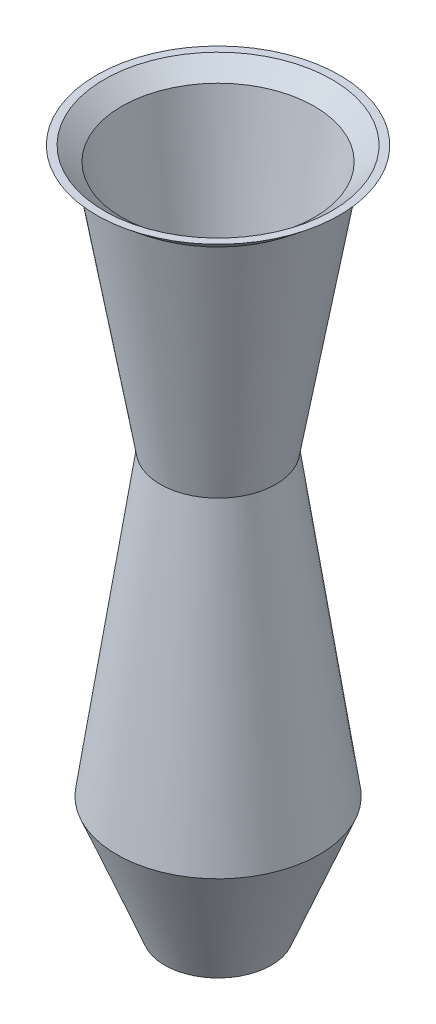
ISO-10303-21;
HEADER;
FILE_DESCRIPTION(('STEP AP214'),'2;1');
FILE_NAME('part.step','',(''),(''),'','','');
FILE_SCHEMA(('AUTOMOTIVE_DESIGN { 1 0 10303 214 1 1 1 1 }'));
ENDSEC;
DATA;
#1=APPLICATION_CONTEXT('core data for automotive mechanical design processes');
#2=APPLICATION_PROTOCOL_DEFINITION('international standard','automotive_design',2000,#1);
#3=PRODUCT_CONTEXT('',#1,'mechanical');
#4=PRODUCT('Part','Part','',(#3));
#5=PRODUCT_RELATED_PRODUCT_CATEGORY('part','',(#4));
#6=PRODUCT_DEFINITION_FORMATION('','',#4);
#7=PRODUCT_DEFINITION_CONTEXT('part definition',#1,'design');
#8=PRODUCT_DEFINITION('design','',#6,#7);
#9=PRODUCT_DEFINITION_SHAPE('','',#8);
#10=(LENGTH_UNIT() NAMED_UNIT(*) SI_UNIT(.MILLI.,.METRE.));
#11=(NAMED_UNIT(*) PLANE_ANGLE_UNIT() SI_UNIT($,.RADIAN.));
#12=(NAMED_UNIT(*) SI_UNIT($,.STERADIAN.) SOLID_ANGLE_UNIT());
#13=UNCERTAINTY_MEASURE_WITH_UNIT(LENGTH_MEASURE(1.E-05),#10,'distance_accuracy_value','');
#14=(GEOMETRIC_REPRESENTATION_CONTEXT(3) GLOBAL_UNCERTAINTY_ASSIGNED_CONTEXT((#13)) GLOBAL_UNIT_ASSIGNED_CONTEXT((#10,
#11,#12)) REPRESENTATION_CONTEXT('',''));
#15=CARTESIAN_POINT('',(0.,0.,0.));
#16=DIRECTION('',(0.,0.,1.));
#17=DIRECTION('',(1.,0.,0.));
#18=AXIS2_PLACEMENT_3D('',#15,#16,#17);
#19=CARTESIAN_POINT('',(0.,-806.372693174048,0.));
#20=DIRECTION('',(0.,-1.,0.));
#21=DIRECTION('',(1.,0.,0.));
#22=AXIS2_PLACEMENT_3D('',#19,#20,#21);
#23=PLANE('',#22);
#24=CARTESIAN_POINT('',(2.7660591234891E-12,-806.372693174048,0.));
#25=DIRECTION('',(0.,-1.,0.));
#26=DIRECTION('',(1.,0.,0.));
#27=AXIS2_PLACEMENT_3D('',#24,#25,#26);
#28=CIRCLE('',#27,253.999999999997);
#29=CARTESIAN_POINT('',(254.,-806.372693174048,0.));
#30=VERTEX_POINT('',#29);
#31=EDGE_CURVE('E82',#30,#30,#28,.T.);
#32=ORIENTED_EDGE('',*,*,#31,.F.);
#33=EDGE_LOOP('',(#32));
#34=FACE_BOUND('',#33,.T.);
#35=CARTESIAN_POINT('',(2.7660591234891E-12,-806.372693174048,0.));
#36=DIRECTION('',(0.,-1.,0.));
#37=DIRECTION('',(1.,0.,0.));
#38=AXIS2_PLACEMENT_3D('',#35,#36,#37);
#39=CIRCLE('',#38,281.356637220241);
#40=CARTESIAN_POINT('',(281.356637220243,-806.372693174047,0.));
#41=VERTEX_POINT('',#40);
#42=EDGE_CURVE('E53',#41,#41,#39,.T.);
#43=ORIENTED_EDGE('',*,*,#42,.T.);
#44=EDGE_LOOP('',(#43));
#45=FACE_BOUND('',#44,.T.);
#46=ADVANCED_FACE('F44',(#34,#45),#23,.T.);
#47=CARTESIAN_POINT('',(2.79841777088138E-12,-815.806016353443,0.));
#48=DIRECTION('',(0.,1.,0.));
#49=DIRECTION('',(-1.,0.,0.));
#50=AXIS2_PLACEMENT_3D('',#47,#48,#49);
#51=CONICAL_SURFACE('',#50,277.583307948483,0.380506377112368);
#52=CARTESIAN_POINT('',(5.98487426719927E-13,-174.47346443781,0.));
#53=DIRECTION('',(0.,-1.,0.));
#54=DIRECTION('',(1.,0.,0.));
#55=AXIS2_PLACEMENT_3D('',#52,#53,#54);
#56=CIRCLE('',#55,534.116328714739);
#57=CARTESIAN_POINT('',(534.116328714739,-174.473464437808,0.));
#58=VERTEX_POINT('',#57);
#59=EDGE_CURVE('E59',#58,#58,#56,.T.);
#60=ORIENTED_EDGE('',*,*,#59,.T.);
#61=EDGE_LOOP('',(#60));
#62=FACE_BOUND('',#61,.T.);
#63=ORIENTED_EDGE('',*,*,#42,.F.);
#64=EDGE_LOOP('',(#63));
#65=FACE_BOUND('',#64,.T.);
#66=ADVANCED_FACE('F123',(#62,#65),#51,.T.);
#67=CARTESIAN_POINT('',(5.75334534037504E-13,-167.723839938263,0.));
#68=DIRECTION('',(0.,-1.,0.));
#69=DIRECTION('',(1.,0.,0.));
#70=AXIS2_PLACEMENT_3D('',#67,#68,#69);
#71=CONICAL_SURFACE('',#70,533.136544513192,0.144154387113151);
#72=CARTESIAN_POINT('',(-4.81290421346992E-12,1403.07721539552,0.));
#73=DIRECTION('',(0.,-1.,0.));
#74=DIRECTION('',(1.,0.,0.));
#75=AXIS2_PLACEMENT_3D('',#72,#73,#74);
#76=CIRCLE('',#75,305.117036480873);
#77=CARTESIAN_POINT('',(305.117036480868,1403.07721539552,0.));
#78=VERTEX_POINT('',#77);
#79=EDGE_CURVE('E10',#78,#78,#76,.T.);
#80=ORIENTED_EDGE('',*,*,#79,.T.);
#81=EDGE_LOOP('',(#80));
#82=FACE_BOUND('',#81,.T.);
#83=ORIENTED_EDGE('',*,*,#59,.F.);
#84=EDGE_LOOP('',(#83));
#85=FACE_BOUND('',#84,.T.);
#86=ADVANCED_FACE('F129',(#82,#85),#71,.T.);
#87=CARTESIAN_POINT('',(-4.79924612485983E-12,1399.09555440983,0.));
#88=DIRECTION('',(0.,1.,0.));
#89=DIRECTION('',(-1.,0.,0.));
#90=AXIS2_PLACEMENT_3D('',#87,#88,#89);
#91=CONICAL_SURFACE('',#90,304.427902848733,0.171379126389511);
#92=ORIENTED_EDGE('',*,*,#79,.F.);
#93=EDGE_LOOP('',(#92));
#94=FACE_BOUND('',#93,.T.);
#95=CARTESIAN_POINT('',(-9.2980222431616E-12,2710.59688266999,0.));
#96=DIRECTION('',(0.,-1.,0.));
#97=DIRECTION('',(1.,0.,0.));
#98=AXIS2_PLACEMENT_3D('',#95,#96,#97);
#99=CIRCLE('',#98,531.418517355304);
#100=CARTESIAN_POINT('',(531.418517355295,2710.59688266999,0.));
#101=VERTEX_POINT('',#100);
#102=EDGE_CURVE('E63',#101,#101,#99,.T.);
#103=ORIENTED_EDGE('',*,*,#102,.T.);
#104=EDGE_LOOP('',(#103));
#105=FACE_BOUND('',#104,.T.);
#106=ADVANCED_FACE('F138',(#94,#105),#91,.T.);
#107=CARTESIAN_POINT('',(-9.27746780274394E-12,2704.60476943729,0.));
#108=DIRECTION('',(0.,1.,0.));
#109=DIRECTION('',(-1.,0.,0.));
#110=AXIS2_PLACEMENT_3D('',#107,#108,#109);
#111=CONICAL_SURFACE('',#110,524.128112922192,0.882833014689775);
#112=CARTESIAN_POINT('',(-9.60616296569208E-12,2800.42730682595,0.));
#113=DIRECTION('',(0.,1.,0.));
#114=DIRECTION('',(-1.,0.,0.));
#115=AXIS2_PLACEMENT_3D('',#112,#113,#114);
#116=CIRCLE('',#115,640.712200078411);
#117=CARTESIAN_POINT('',(-640.712200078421,2800.42730682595,0.));
#118=VERTEX_POINT('',#117);
#119=EDGE_CURVE('E48',#118,#118,#116,.F.);
#120=ORIENTED_EDGE('',*,*,#119,.T.);
#121=EDGE_LOOP('',(#120));
#122=FACE_BOUND('',#121,.T.);
#123=ORIENTED_EDGE('',*,*,#102,.F.);
#124=EDGE_LOOP('',(#123));
#125=FACE_BOUND('',#124,.T.);
#126=ADVANCED_FACE('F46',(#122,#125),#111,.T.);
#127=CARTESIAN_POINT('',(600.710000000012,2800.42730682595,0.));
#128=DIRECTION('',(0.,1.,0.));
#129=DIRECTION('',(-1.,0.,0.));
#130=AXIS2_PLACEMENT_3D('',#127,#128,#129);
#131=PLANE('',#130);
#132=CARTESIAN_POINT('',(-9.60616296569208E-12,2800.42730682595,0.));
#133=DIRECTION('',(0.,-1.,0.));
#134=DIRECTION('',(1.,0.,0.));
#135=AXIS2_PLACEMENT_3D('',#132,#133,#134);
#136=CIRCLE('',#135,600.710000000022);
#137=CARTESIAN_POINT('',(600.710000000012,2800.42730682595,0.));
#138=VERTEX_POINT('',#137);
#139=EDGE_CURVE('E96',#138,#138,#136,.T.);
#140=ORIENTED_EDGE('',*,*,#139,.T.);
#141=EDGE_LOOP('',(#140));
#142=FACE_BOUND('',#141,.T.);
#143=ORIENTED_EDGE('',*,*,#119,.F.);
#144=EDGE_LOOP('',(#143));
#145=FACE_BOUND('',#144,.T.);
#146=ADVANCED_FACE('F101',(#142,#145),#131,.T.);
#147=CARTESIAN_POINT('',(-4.81296425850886E-12,1403.09471996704,0.));
#148=DIRECTION('',(0.,1.,0.));
#149=DIRECTION('',(-1.,0.,0.));
#150=AXIS2_PLACEMENT_3D('',#147,#148,#149);
#151=TOROIDAL_SURFACE('',#150,303.83118465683,24.13);
#152=CARTESIAN_POINT('',(-4.82708029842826E-12,1407.20988476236,0.));
#153=DIRECTION('',(0.,1.,0.));
#154=DIRECTION('',(-1.,0.,0.));
#155=AXIS2_PLACEMENT_3D('',#152,#153,#154);
#156=CIRCLE('',#155,280.054676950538);
#157=CARTESIAN_POINT('',(-280.054676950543,1407.20988476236,0.));
#158=VERTEX_POINT('',#157);
#159=EDGE_CURVE('E77',#158,#158,#156,.T.);
#160=ORIENTED_EDGE('',*,*,#159,.T.);
#161=EDGE_LOOP('',(#160));
#162=FACE_BOUND('',#161,.T.);
#163=CARTESIAN_POINT('',(-4.80107360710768E-12,1399.62830939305,0.));
#164=DIRECTION('',(0.,-1.,0.));
#165=DIRECTION('',(1.,0.,0.));
#166=AXIS2_PLACEMENT_3D('',#163,#164,#165);
#167=CIRCLE('',#166,279.951467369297);
#168=CARTESIAN_POINT('',(279.951467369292,1399.62830939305,0.));
#169=VERTEX_POINT('',#168);
#170=EDGE_CURVE('E72',#169,#169,#167,.T.);
#171=ORIENTED_EDGE('',*,*,#170,.T.);
#172=EDGE_LOOP('',(#171));
#173=FACE_BOUND('',#172,.T.);
#174=ADVANCED_FACE('F147',(#162,#173),#151,.T.);
#175=CARTESIAN_POINT('',(2.7660591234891E-12,-806.372693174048,0.));
#176=DIRECTION('',(0.,1.,0.));
#177=DIRECTION('',(-1.,0.,0.));
#178=AXIS2_PLACEMENT_3D('',#175,#176,#177);
#179=CONICAL_SURFACE('',#178,253.999999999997,0.380506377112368);
#180=CARTESIAN_POINT('',(5.8785100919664E-13,-171.372693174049,0.));
#181=DIRECTION('',(0.,-1.,0.));
#182=DIRECTION('',(1.,0.,0.));
#183=AXIS2_PLACEMENT_3D('',#180,#181,#182);
#184=CIRCLE('',#183,507.999999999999);
#185=CARTESIAN_POINT('',(508.,-171.372693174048,0.));
#186=VERTEX_POINT('',#185);
#187=EDGE_CURVE('E88',#186,#186,#184,.T.);
#188=ORIENTED_EDGE('',*,*,#187,.F.);
#189=EDGE_LOOP('',(#188));
#190=FACE_BOUND('',#189,.T.);
#191=ORIENTED_EDGE('',*,*,#31,.T.);
#192=EDGE_LOOP('',(#191));
#193=FACE_BOUND('',#192,.T.);
#194=ADVANCED_FACE('F118',(#190,#193),#179,.F.);
#195=CARTESIAN_POINT('',(5.8785100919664E-13,-171.372693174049,0.));
#196=DIRECTION('',(0.,-1.,0.));
#197=DIRECTION('',(1.,0.,0.));
#198=AXIS2_PLACEMENT_3D('',#195,#196,#197);
#199=CONICAL_SURFACE('',#198,507.999999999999,0.144154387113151);
#200=ORIENTED_EDGE('',*,*,#170,.F.);
#201=EDGE_LOOP('',(#200));
#202=FACE_BOUND('',#201,.T.);
#203=ORIENTED_EDGE('',*,*,#187,.T.);
#204=EDGE_LOOP('',(#203));
#205=FACE_BOUND('',#204,.T.);
#206=ADVANCED_FACE('F112',(#202,#205),#199,.F.);
#207=CARTESIAN_POINT('',(-4.81410511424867E-12,1403.42730682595,0.));
#208=DIRECTION('',(0.,1.,0.));
#209=DIRECTION('',(-1.,0.,0.));
#210=AXIS2_PLACEMENT_3D('',#207,#208,#209);
#211=CONICAL_SURFACE('',#210,279.400000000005,0.171379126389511);
#212=ORIENTED_EDGE('',*,*,#159,.F.);
#213=EDGE_LOOP('',(#212));
#214=FACE_BOUND('',#213,.T.);
#215=CARTESIAN_POINT('',(-9.34477799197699E-12,2724.22730682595,0.));
#216=DIRECTION('',(0.,-1.,0.));
#217=DIRECTION('',(1.,0.,0.));
#218=AXIS2_PLACEMENT_3D('',#215,#216,#217);
#219=CIRCLE('',#218,508.000000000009);
#220=CARTESIAN_POINT('',(508.,2724.22730682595,0.));
#221=VERTEX_POINT('',#220);
#222=EDGE_CURVE('E92',#221,#221,#219,.T.);
#223=ORIENTED_EDGE('',*,*,#222,.F.);
#224=EDGE_LOOP('',(#223));
#225=FACE_BOUND('',#224,.T.);
#226=ADVANCED_FACE('F107',(#214,#225),#211,.F.);
#227=CARTESIAN_POINT('',(-9.34477799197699E-12,2724.22730682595,0.));
#228=DIRECTION('',(0.,1.,0.));
#229=DIRECTION('',(-1.,0.,0.));
#230=AXIS2_PLACEMENT_3D('',#227,#228,#229);
#231=CONICAL_SURFACE('',#230,508.000000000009,0.882833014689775);
#232=ORIENTED_EDGE('',*,*,#139,.F.);
#233=EDGE_LOOP('',(#232));
#234=FACE_BOUND('',#233,.T.);
#235=ORIENTED_EDGE('',*,*,#222,.T.);
#236=EDGE_LOOP('',(#235));
#237=FACE_BOUND('',#236,.T.);
#238=ADVANCED_FACE('F104',(#234,#237),#231,.F.);
#239=CLOSED_SHELL('',(#46,#66,#86,#106,#126,#146,#174,#194,#206,#226,#238));
#240=MANIFOLD_SOLID_BREP('B2',#239);
#241=ADVANCED_BREP_SHAPE_REPRESENTATION('',(#18,#240),#14);
#242=SHAPE_DEFINITION_REPRESENTATION(#9,#241);
ENDSEC;
END-ISO-10303-21;
